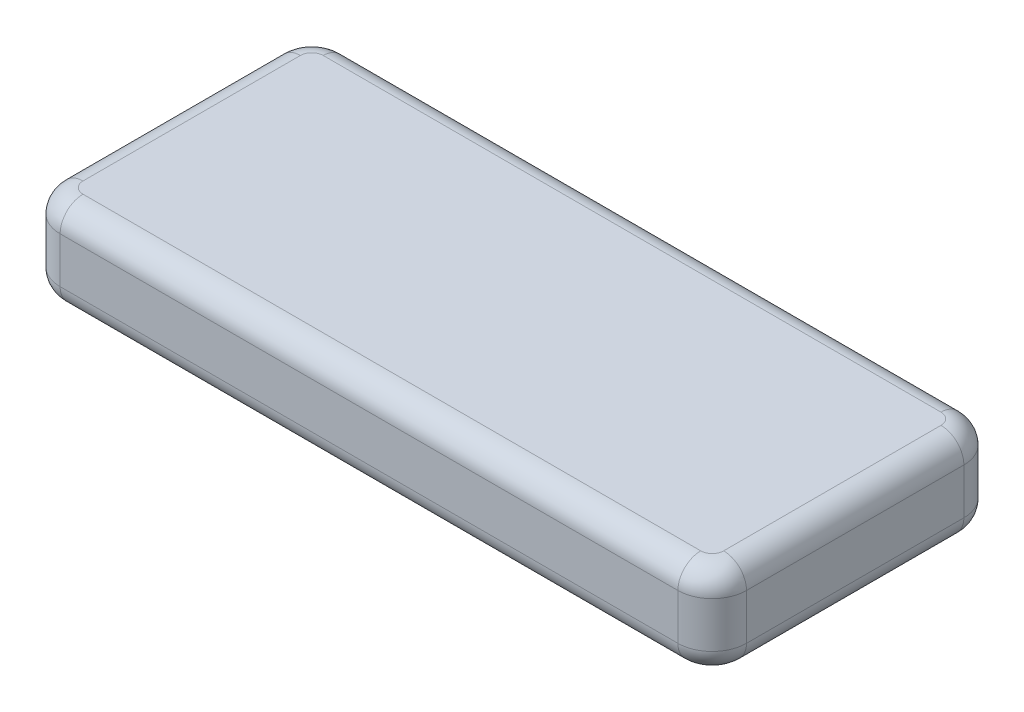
from build123d import *

# Parameters (mm, degrees)
EXTRUDE_1_DEPTH = 4
FILLET_1_R      = 2


with BuildPart() as part:
    # Sketch 1 → Extrude 1 (new, symmetric)
    with BuildSketch(Plane(origin=(0, 0, 0), x_dir=(1, 0, 0), z_dir=(0, 1, 0))):
        with BuildLine():
            Line((-27, -12.5), (27, -12.5))
            ThreePointArc((27, -12.5), (29.121320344, -11.621320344), (30, -9.5))
            Line((30, -9.5), (30, 9.5))
            ThreePointArc((30, 9.5), (29.121320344, 11.621320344), (27, 12.5))
            Line((27, 12.5), (-27, 12.5))
            ThreePointArc((-27, 12.5), (-29.121320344, 11.621320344), (-30, 9.5))
            Line((-30, 9.5), (-30, -9.5))
            ThreePointArc((-30, -9.5), (-29.121320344, -11.621320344), (-27, -12.5))
        make_face()
    extrude(amount=EXTRUDE_1_DEPTH, both=True)

    # Fillet 1
    fillet_1_edges = [part.edges().sort_by_distance(p)[0] for p in [
        (0, -4, -12.5),
        (29.121320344, -4, -11.621320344),
        (30, -4, 0),
        (29.121320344, -4, 11.621320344),
        (29.121320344, 4, -11.621320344),
        (0, 4, -12.5),
        (-29.121320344, 4, -11.621320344),
        (-30, 4, 0),
        (-29.121320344, 4, 11.621320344),
        (0, 4, 12.5),
        (29.121320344, 4, 11.621320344),
        (0, -4, 12.5),
        (30, 4, 0),
        (-29.121320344, -4, 11.621320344),
        (-30, -4, 0),
        (-29.121320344, -4, -11.621320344),
    ]]
    fillet(fillet_1_edges, radius=FILLET_1_R)


solid = part.part
